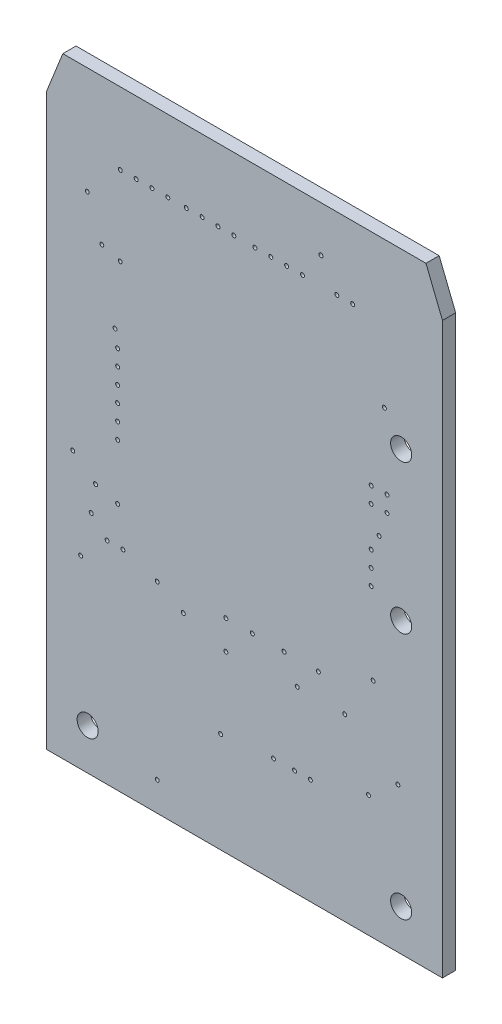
from build123d import *

# Parameters (mm, degrees)
BOARD_OUTLINE_DEPTH = 0.508
SKETCH2_R           = 0.0762
NPTH_DEPTH          = 29.009474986
SKETCH3_R           = 0.405
PTH_DEPTH           = 29.009474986


with BuildPart() as part:
    # Sketch1 → Board_Outline (new body)
    with BuildSketch(Plane.XY):
        Polygon((0, 0), (0, 21.9075), (0.635, 23.495), (14.605, 23.495), (15.24, 21.9075), (15.24, 0), align=None)
    extrude(amount=BOARD_OUTLINE_DEPTH)

    # Sketch2 → NPTH (cut, through all)
    with BuildSketch(Plane.XY):
        with Locations((13.0048, 17.8816)):
            Circle(SKETCH2_R)
        with Locations((13.1064, 15.0368)):
            Circle(SKETCH2_R)
        with Locations((12.573, 8.5725)):
            Circle(SKETCH2_R)
        with Locations((13.5255, 5.588)):
            Circle(SKETCH2_R)
        with Locations((5.2705, 7.1755)):
            Circle(SKETCH2_R)
        with Locations((1.5748, 19.3675)):
            Circle(SKETCH2_R)
        with Locations((1.8923, 9.779)):
            Circle(SKETCH2_R)
        with Locations((2.1336, 17.8816)):
            Circle(SKETCH2_R)
        with Locations((3.4544, 20.7264)):
            Circle(SKETCH2_R)
        with Locations((2.6416, 15.3416)):
            Circle(SKETCH2_R)
        with Locations((2.8448, 20.7264)):
            Circle(SKETCH2_R)
        with Locations((2.8448, 17.6784)):
            Circle(SKETCH2_R)
        with Locations((4.064, 20.7264)):
            Circle(SKETCH2_R)
        with Locations((2.7432, 14.732)):
            Circle(SKETCH2_R)
        with Locations((4.6736, 20.7264)):
            Circle(SKETCH2_R)
        with Locations((2.7432, 14.1224)):
            Circle(SKETCH2_R)
        with Locations((5.3848, 20.7264)):
            Circle(SKETCH2_R)
        with Locations((2.7432, 13.5128)):
            Circle(SKETCH2_R)
        with Locations((5.9944, 20.7264)):
            Circle(SKETCH2_R)
        with Locations((2.7432, 12.9032)):
            Circle(SKETCH2_R)
        with Locations((6.604, 20.7264)):
            Circle(SKETCH2_R)
        with Locations((2.7432, 12.2936)):
            Circle(SKETCH2_R)
        with Locations((7.2136, 20.7264)):
            Circle(SKETCH2_R)
        with Locations((2.7432, 11.684)):
            Circle(SKETCH2_R)
        with Locations((8.0264, 20.7264)):
            Circle(SKETCH2_R)
        with Locations((12.4968, 11.684)):
            Circle(SKETCH2_R)
        with Locations((11.7856, 20.7264)):
            Circle(SKETCH2_R)
        with Locations((12.4968, 15.0368)):
            Circle(SKETCH2_R)
        with Locations((11.176, 20.7264)):
            Circle(SKETCH2_R)
        with Locations((12.4968, 14.4272)):
            Circle(SKETCH2_R)
        with Locations((10.5664, 21.7424)):
            Circle(SKETCH2_R)
        with Locations((13.1064, 14.4272)):
            Circle(SKETCH2_R)
        with Locations((9.8552, 20.7264)):
            Circle(SKETCH2_R)
        with Locations((12.8016, 13.5128)):
            Circle(SKETCH2_R)
        with Locations((9.2456, 20.7264)):
            Circle(SKETCH2_R)
        with Locations((12.4968, 12.9032)):
            Circle(SKETCH2_R)
        with Locations((8.636, 20.7264)):
            Circle(SKETCH2_R)
        with Locations((12.4968, 12.2936)):
            Circle(SKETCH2_R)
        with Locations((6.9088, 7.8232)):
            Circle(SKETCH2_R)
        with Locations((8.7376, 4.064)):
            Circle(SKETCH2_R)
        with Locations((6.7056, 3.8608)):
            Circle(SKETCH2_R)
        with Locations((6.9088, 6.7056)):
            Circle(SKETCH2_R)
        with Locations((7.9248, 7.8232)):
            Circle(SKETCH2_R)
        with Locations((9.5504, 4.064)):
            Circle(SKETCH2_R)
        with Locations((12.3952, 4.6736)):
            Circle(SKETCH2_R)
        with Locations((9.652, 6.9088)):
            Circle(SKETCH2_R)
        with Locations((10.16, 4.064)):
            Circle(SKETCH2_R)
        with Locations((9.144, 7.8232)):
            Circle(SKETCH2_R)
        with Locations((10.4648, 7.8232)):
            Circle(SKETCH2_R)
        with Locations((11.4808, 6.9088)):
            Circle(SKETCH2_R)
        with Locations((2.7432, 9.5504)):
            Circle(SKETCH2_R)
        with Locations((1.3208, 7.112)):
            Circle(SKETCH2_R)
        with Locations((2.9464, 8.128)):
            Circle(SKETCH2_R)
        with Locations((1.016, 10.4648)):
            Circle(SKETCH2_R)
        with Locations((1.7272, 8.7376)):
            Circle(SKETCH2_R)
        with Locations((2.3368, 8.128)):
            Circle(SKETCH2_R)
        with Locations((4.2672, 1.1176)):
            Circle(SKETCH2_R)
        with Locations((4.2672, 7.7216)):
            Circle(SKETCH2_R)
    extrude(amount=NPTH_DEPTH, mode=Mode.SUBTRACT)

    # Sketch3 → PTH (cut, through all)
    with BuildSketch(Plane.XY):
        with Locations((13.65, 1.59)):
            Circle(SKETCH3_R)
        with Locations((1.59, 1.59)):
            Circle(SKETCH3_R)
        with Locations((13.65, 16.83)):
            Circle(SKETCH3_R)
        with Locations((13.65, 11.11)):
            Circle(SKETCH3_R)
    extrude(amount=PTH_DEPTH, mode=Mode.SUBTRACT)


solid = part.part
